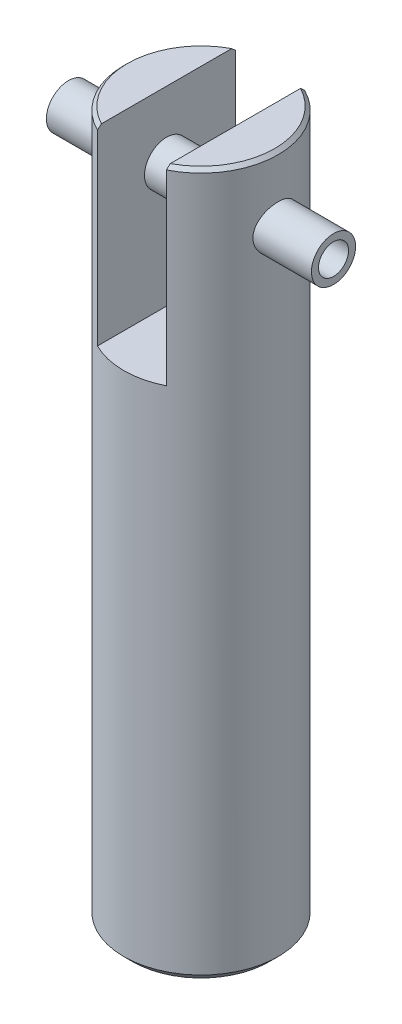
from build123d import *

# Parameters (mm, degrees)
SKETCH1_R               = 5.5499
BOSS_EXTRUDE1_DEPTH     = 50.8
SKETCH2_W               = 4.953
SKETCH2_H               = 19.05
CUT_EXTRUDE1_DEPTH      = 13.6906
CUT_EXTRUDE2_DEPTH      = 52.402750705
CUT_EXTRUDE2_DEPTH_BACK = 52.402750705
SKETCH3_R               = 1.5875
CHAMFER1_SIZE           = 0.635
CHAMFER2_SIZE           = 0.254
SKETCH4_R               = 1.5875
BOSS_EXTRUDE2_DEPTH     = 9.525
SKETCH5_R               = 1.0795
CUT_EXTRUDE3_DEPTH      = 55.537545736


with BuildPart() as part:
    # Sketch1 → Boss-Extrude1 (new body)
    with BuildSketch(Plane(origin=(0, 0, 0), x_dir=(1, 0, 0), z_dir=(0, 1, 0))):
        with Locations(Location((0, 0, 0), (0, 0, 270))):
            Circle(SKETCH1_R)
    extrude(amount=BOSS_EXTRUDE1_DEPTH)

    # Sketch2 → Cut-Extrude1 (cut)
    with BuildSketch(Plane(origin=(0, 50.8, 0), x_dir=(1, 0, 0), z_dir=(0, 1, 0))):
        Rectangle(SKETCH2_W, SKETCH2_H)
    extrude(amount=-CUT_EXTRUDE1_DEPTH, mode=Mode.SUBTRACT)

    # Sketch3 → Cut-Extrude2 (cut, two sides: drawn at the far end of the back side and taken through both)
    with BuildSketch(Plane(origin=(0, 0, 0), x_dir=(0, 0, -1), z_dir=(1, 0, 0)).offset(-CUT_EXTRUDE2_DEPTH_BACK)):
        with Locations(Location((0, 46.0375, 0), (0, 0, 270))):
            Circle(SKETCH3_R)
    extrude(amount=CUT_EXTRUDE2_DEPTH + CUT_EXTRUDE2_DEPTH_BACK, mode=Mode.SUBTRACT)

    # Chamfer1
    chamfer1_edges = [part.edges().sort_by_distance(p)[0] for p in [
        (0, 0, -5.5499),
    ]]
    chamfer(chamfer1_edges, length=CHAMFER1_SIZE)

    # Chamfer2
    chamfer2_edges = [part.edges().sort_by_distance(p)[0] for p in [
        (5.5499, 50.8, 0),
        (-5.5499, 50.8, 0),
    ]]
    chamfer(chamfer2_edges, length=CHAMFER2_SIZE)

    # Sketch4 → Boss-Extrude2 (add, symmetric)
    with BuildSketch(Plane(origin=(0, 0, 0), x_dir=(0, 0, -1), z_dir=(1, 0, 0))):
        with Locations(Location((0, 46.0375, 0), (0, 0, 180))):
            Circle(SKETCH4_R)
    extrude(amount=BOSS_EXTRUDE2_DEPTH, both=True)

    # Sketch5 → Cut-Extrude3 (cut, through all)
    with BuildSketch(Plane(origin=(9.525, 0, 0), x_dir=(0, 0, -1), z_dir=(1, 0, 0))):
        with Locations((0, 46.0375)):
            Circle(SKETCH5_R)
    extrude(amount=-CUT_EXTRUDE3_DEPTH, mode=Mode.SUBTRACT)


solid = part.part
